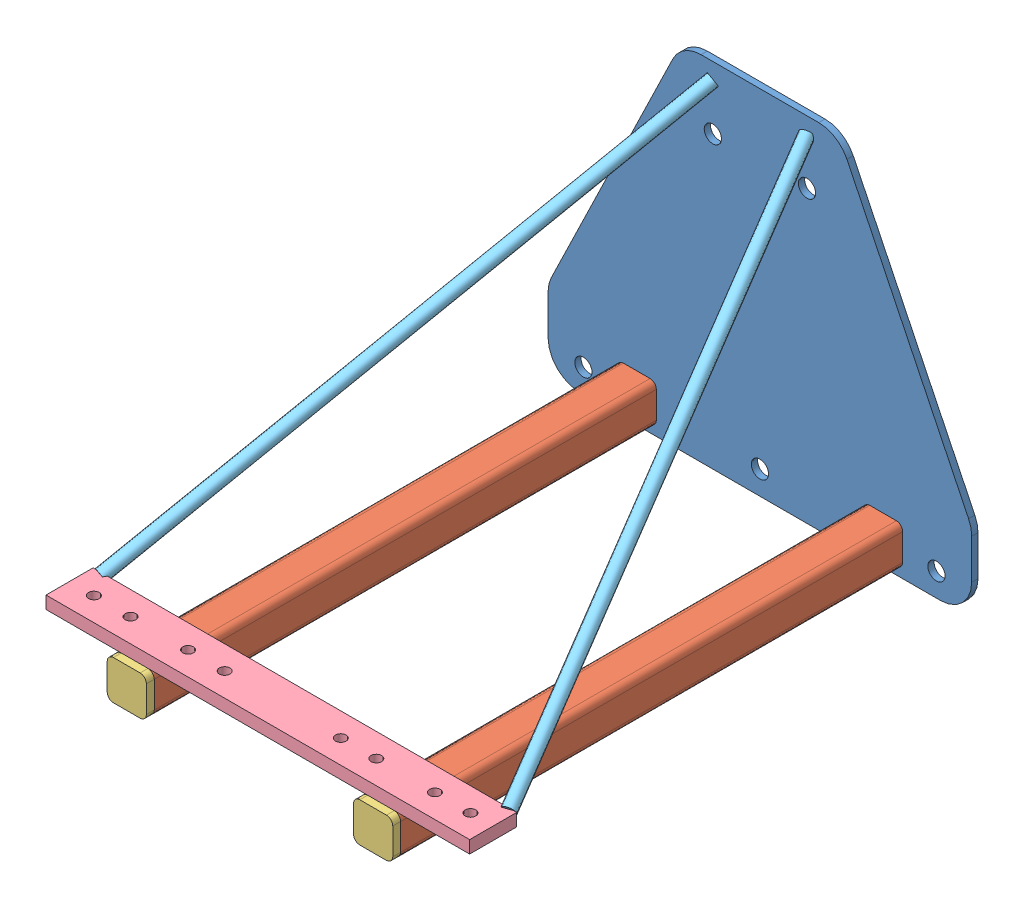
SolidWorks assembly FM20.SLDASM, configuration Défaut (file format 4100). Lengths in mm.
Overall size (270.85 225 329).
8 component instances, 5 part files, 20 mates.
Components (placement in the parent):
- FM20_REPA-1: FM20_REPA.SLDPRT [Défaut] at origin size (270 225 4)
- FM20_REPB-1: FM20_REPB.SLDPRT [Défaut] at (-78.5 17.5 164) size (25 25 320)
- FM20_REPB-2: FM20_REPB.SLDPRT [Défaut] at (78.5 17.5 164) size (25 25 320)
- FM20_REPC-1: FM20_REPC.SLDPRT [Défaut] at (-78.5 17.5 324) size (25 25 5)
- FM20_REPC-3: FM20_REPC.SLDPRT [Défaut] at (78.5 17.5 324) size (25 25 5)
- FM20_REPD-1: FM20_REPD.SLDPRT [Défaut] at (0 30 309) x (1 0 0) z (0 1 0) size (270 30 8)
- FM20_REPE-1: FM20_REPE.SLDPRT [Défaut] at (-30 215 4) x (0.657083 -0.721603 -0.218016) z (-0.28169 -0.503312 0.816901) size (8 8 355)
- FM20_REPE-2: FM20_REPE.SLDPRT [Défaut] at (30 215 4) x (0.657083 0.721603 0.218016) z (0.28169 -0.503312 0.816901) size (8 8 355)
Mates (geometry in assembly coordinates):
- Coïncidente1: coincident anti-aligned: plane of FM20_REPA-1 through (50 225 4) normal (0 0 1); plane of FM20_REPB-1 through (-66 30 4) normal (0 0 -1)
- Distance1: distance = 91 mm anti-aligned: plane of assembly; plane of FM20_REPB-1 through (-91 30 324) normal (-1 0 0)
- Distance2: distance = 30 mm anti-aligned: plane of FM20_REPB-1 through (-91 30 324) normal (0 1 0); plane of FM20_REPA-1 through (135 0 4) normal (0 -1 0)
- Coïncidente4: coincident aligned: plane of FM20_REPB-1 through (-91 5 324) normal (0 -1 0); plane of FM20_REPB-2 through (66 5 324) normal (0 -1 0)
- Distance3: distance = 182 mm anti-aligned: plane of FM20_REPB-1 through (-91 30 324) normal (-1 0 0); plane of FM20_REPB-2 through (91 30 324) normal (1 0 0)
- Coïncidente5: coincident anti-aligned: plane of FM20_REPA-1 through (50 225 4) normal (0 0 1); plane of FM20_REPB-2 through (91 30 4) normal (0 0 -1)
- Coïncidente6: coincident anti-aligned: plane of FM20_REPB-1 through (-66 30 324) normal (0 0 1); plane of FM20_REPC-1 through (-66 5 324) normal (0 0 -1)
- Coïncidente7: coincident aligned: plane of FM20_REPB-1 through (-66 30 324) normal (1 0 0); plane of FM20_REPC-1 through (-66 30 329) normal (1 0 0)
- Coïncidente8: coincident aligned: plane of FM20_REPB-1 through (-91 30 324) normal (0 1 0); plane of FM20_REPC-1 through (-91 30 329) normal (0 1 0)
- Coïncidente9: coincident anti-aligned: plane of FM20_REPB-2 through (91 30 324) normal (0 0 1); plane of FM20_REPC-3 through (91 5 324) normal (0 0 -1)
- Coïncidente10: coincident aligned: plane of FM20_REPB-2 through (91 30 324) normal (1 0 0); plane of FM20_REPC-3 through (91 30 329) normal (1 0 0)
- Coïncidente11: coincident aligned: plane of FM20_REPB-2 through (66 30 324) normal (0 1 0); plane of FM20_REPC-3 through (66 30 329) normal (0 1 0)
- Coïncidente12: coincident anti-aligned: plane of FM20_REPB-1 through (-91 30 324) normal (0 1 0); plane of FM20_REPD-1 through (135 30 324) normal (0 -1 0)
- Coïncidente13: coincident aligned: plane of FM20_REPD-1; plane of assembly
- Coïncidente14: coincident aligned: plane of FM20_REPB-1 through (-66 30 324) normal (0 0 1); plane of FM20_REPD-1 through (-135 38 324) normal (0 0 1)
- Distance4: distance = 30 mm: point of FM20_REPE-1; plane of assembly
- Distance5: distance = 130 mm: point of FM20_REPE-1; plane of assembly
- Distance8: distance: plane of FM20_REPA-1 through (50 225 4) normal (0 0 1); point of FM20_REPE-1
- Distance6: distance = 10 mm: point of FM20_REPE-1; plane of FM20_REPA-1 through (-50 225 4) normal (0 1 0)
- Coïncidente23: coincident: plane of FM20_REPD-1 through (-135 38 294) normal (0 0 -1); point of FM20_REPE-1
